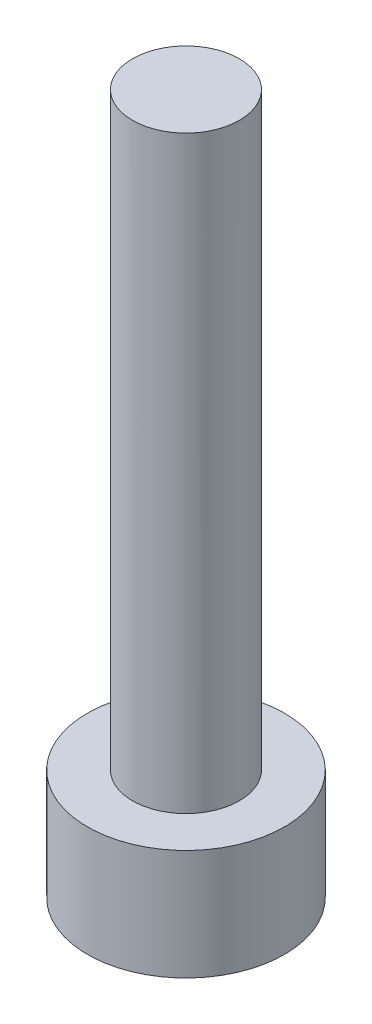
ISO-10303-21;
HEADER;
FILE_DESCRIPTION(('STEP AP214'),'2;1');
FILE_NAME('part.step','',(''),(''),'','','');
FILE_SCHEMA(('AUTOMOTIVE_DESIGN { 1 0 10303 214 1 1 1 1 }'));
ENDSEC;
DATA;
#1=APPLICATION_CONTEXT('core data for automotive mechanical design processes');
#2=APPLICATION_PROTOCOL_DEFINITION('international standard','automotive_design',2000,#1);
#3=PRODUCT_CONTEXT('',#1,'mechanical');
#4=PRODUCT('Part','Part','',(#3));
#5=PRODUCT_RELATED_PRODUCT_CATEGORY('part','',(#4));
#6=PRODUCT_DEFINITION_FORMATION('','',#4);
#7=PRODUCT_DEFINITION_CONTEXT('part definition',#1,'design');
#8=PRODUCT_DEFINITION('design','',#6,#7);
#9=PRODUCT_DEFINITION_SHAPE('','',#8);
#10=(LENGTH_UNIT() NAMED_UNIT(*) SI_UNIT(.MILLI.,.METRE.));
#11=(NAMED_UNIT(*) PLANE_ANGLE_UNIT() SI_UNIT($,.RADIAN.));
#12=(NAMED_UNIT(*) SI_UNIT($,.STERADIAN.) SOLID_ANGLE_UNIT());
#13=UNCERTAINTY_MEASURE_WITH_UNIT(LENGTH_MEASURE(1.E-05),#10,'distance_accuracy_value','');
#14=(GEOMETRIC_REPRESENTATION_CONTEXT(3) GLOBAL_UNCERTAINTY_ASSIGNED_CONTEXT((#13)) GLOBAL_UNIT_ASSIGNED_CONTEXT((#10,
#11,#12)) REPRESENTATION_CONTEXT('',''));
#15=CARTESIAN_POINT('',(0.,0.,0.));
#16=DIRECTION('',(0.,0.,1.));
#17=DIRECTION('',(1.,0.,0.));
#18=AXIS2_PLACEMENT_3D('',#15,#16,#17);
#19=CARTESIAN_POINT('',(0.,16.,0.));
#20=DIRECTION('',(0.,-1.,0.));
#21=DIRECTION('',(0.,0.,-1.));
#22=AXIS2_PLACEMENT_3D('',#19,#20,#21);
#23=CYLINDRICAL_SURFACE('',#22,1.45);
#24=CARTESIAN_POINT('',(0.,16.,0.));
#25=DIRECTION('',(0.,1.,0.));
#26=DIRECTION('',(0.,0.,1.));
#27=AXIS2_PLACEMENT_3D('',#24,#25,#26);
#28=CIRCLE('',#27,1.45);
#29=CARTESIAN_POINT('',(0.,16.,1.45));
#30=VERTEX_POINT('',#29);
#31=EDGE_CURVE('E11',#30,#30,#28,.T.);
#32=ORIENTED_EDGE('',*,*,#31,.F.);
#33=EDGE_LOOP('',(#32));
#34=FACE_BOUND('',#33,.T.);
#35=CARTESIAN_POINT('',(0.,0.,0.));
#36=DIRECTION('',(0.,-1.,0.));
#37=DIRECTION('',(0.,0.,-1.));
#38=AXIS2_PLACEMENT_3D('',#35,#36,#37);
#39=CIRCLE('',#38,1.45);
#40=CARTESIAN_POINT('',(0.,0.,-1.45));
#41=VERTEX_POINT('',#40);
#42=EDGE_CURVE('E46',#41,#41,#39,.T.);
#43=ORIENTED_EDGE('',*,*,#42,.F.);
#44=EDGE_LOOP('',(#43));
#45=FACE_BOUND('',#44,.T.);
#46=ADVANCED_FACE('F38',(#34,#45),#23,.T.);
#47=CARTESIAN_POINT('',(0.,16.,0.));
#48=DIRECTION('',(0.,1.,0.));
#49=DIRECTION('',(0.,0.,1.));
#50=AXIS2_PLACEMENT_3D('',#47,#48,#49);
#51=PLANE('',#50);
#52=ORIENTED_EDGE('',*,*,#31,.T.);
#53=EDGE_LOOP('',(#52));
#54=FACE_BOUND('',#53,.T.);
#55=ADVANCED_FACE('F187',(#54),#51,.T.);
#56=CARTESIAN_POINT('',(0.,0.,0.));
#57=DIRECTION('',(0.,-1.,0.));
#58=DIRECTION('',(0.,0.,-1.));
#59=AXIS2_PLACEMENT_3D('',#56,#57,#58);
#60=PLANE('',#59);
#61=CARTESIAN_POINT('',(0.,0.,0.));
#62=DIRECTION('',(0.,-1.,0.));
#63=DIRECTION('',(0.,0.,-1.));
#64=AXIS2_PLACEMENT_3D('',#61,#62,#63);
#65=CIRCLE('',#64,2.675);
#66=CARTESIAN_POINT('',(0.,0.,-2.675));
#67=VERTEX_POINT('',#66);
#68=EDGE_CURVE('E165',#67,#67,#65,.T.);
#69=ORIENTED_EDGE('',*,*,#68,.F.);
#70=EDGE_LOOP('',(#69));
#71=FACE_BOUND('',#70,.T.);
#72=ORIENTED_EDGE('',*,*,#42,.T.);
#73=EDGE_LOOP('',(#72));
#74=FACE_BOUND('',#73,.T.);
#75=ADVANCED_FACE('F184',(#71,#74),#60,.F.);
#76=CARTESIAN_POINT('',(0.,-3.,0.));
#77=DIRECTION('',(0.,1.,0.));
#78=DIRECTION('',(0.,0.,1.));
#79=AXIS2_PLACEMENT_3D('',#76,#77,#78);
#80=CYLINDRICAL_SURFACE('',#79,2.675);
#81=CARTESIAN_POINT('',(0.,-3.,0.));
#82=DIRECTION('',(0.,-1.,0.));
#83=DIRECTION('',(0.,0.,-1.));
#84=AXIS2_PLACEMENT_3D('',#81,#82,#83);
#85=CIRCLE('',#84,2.675);
#86=CARTESIAN_POINT('',(0.,-3.,-2.675));
#87=VERTEX_POINT('',#86);
#88=EDGE_CURVE('E174',#87,#87,#85,.T.);
#89=ORIENTED_EDGE('',*,*,#88,.F.);
#90=EDGE_LOOP('',(#89));
#91=FACE_BOUND('',#90,.T.);
#92=ORIENTED_EDGE('',*,*,#68,.T.);
#93=EDGE_LOOP('',(#92));
#94=FACE_BOUND('',#93,.T.);
#95=ADVANCED_FACE('F197',(#91,#94),#80,.T.);
#96=CARTESIAN_POINT('',(0.,-3.,0.));
#97=DIRECTION('',(0.,-1.,0.));
#98=DIRECTION('',(0.,0.,-1.));
#99=AXIS2_PLACEMENT_3D('',#96,#97,#98);
#100=PLANE('',#99);
#101=DIRECTION('',(0.23586840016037,0.,0.971785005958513));
#102=VECTOR('',#101,1.);
#103=CARTESIAN_POINT('',(1.25340948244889,-3.,-1.19539310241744));
#104=LINE('',#103,#102);
#105=CARTESIAN_POINT('',(1.25340948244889,-3.,-1.19539310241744));
#106=VERTEX_POINT('',#105);
#107=CARTESIAN_POINT('',(1.66194553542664,-3.,0.487787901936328));
#108=VERTEX_POINT('',#107);
#109=EDGE_CURVE('E55',#106,#108,#104,.T.);
#110=ORIENTED_EDGE('',*,*,#109,.F.);
#111=DIRECTION('',(0.95952470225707,0.,0.281624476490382));
#112=VECTOR('',#111,1.);
#113=CARTESIAN_POINT('',(-0.408536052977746,-3.,-1.68318100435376));
#114=LINE('',#113,#112);
#115=CARTESIAN_POINT('',(-0.408536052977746,-3.,-1.68318100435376));
#116=VERTEX_POINT('',#115);
#117=EDGE_CURVE('E159',#116,#106,#114,.T.);
#118=ORIENTED_EDGE('',*,*,#117,.F.);
#119=DIRECTION('',(0.723656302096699,0.,-0.690160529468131));
#120=VECTOR('',#119,1.);
#121=CARTESIAN_POINT('',(-1.66194553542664,-3.,-0.487787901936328));
#122=LINE('',#121,#120);
#123=CARTESIAN_POINT('',(-1.66194553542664,-3.,-0.487787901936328));
#124=VERTEX_POINT('',#123);
#125=EDGE_CURVE('E156',#124,#116,#122,.T.);
#126=ORIENTED_EDGE('',*,*,#125,.F.);
#127=DIRECTION('',(-0.23586840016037,0.,-0.971785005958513));
#128=VECTOR('',#127,1.);
#129=CARTESIAN_POINT('',(-1.25340948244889,-3.,1.19539310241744));
#130=LINE('',#129,#128);
#131=CARTESIAN_POINT('',(-1.25340948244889,-3.,1.19539310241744));
#132=VERTEX_POINT('',#131);
#133=EDGE_CURVE('E113',#132,#124,#130,.T.);
#134=ORIENTED_EDGE('',*,*,#133,.F.);
#135=DIRECTION('',(-0.95952470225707,0.,-0.281624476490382));
#136=VECTOR('',#135,1.);
#137=CARTESIAN_POINT('',(0.408536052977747,-3.,1.68318100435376));
#138=LINE('',#137,#136);
#139=CARTESIAN_POINT('',(0.408536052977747,-3.,1.68318100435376));
#140=VERTEX_POINT('',#139);
#141=EDGE_CURVE('E150',#140,#132,#138,.T.);
#142=ORIENTED_EDGE('',*,*,#141,.F.);
#143=DIRECTION('',(-0.723656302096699,0.,0.690160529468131));
#144=VECTOR('',#143,1.);
#145=CARTESIAN_POINT('',(1.66194553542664,-3.,0.487787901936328));
#146=LINE('',#145,#144);
#147=EDGE_CURVE('E146',#108,#140,#146,.T.);
#148=ORIENTED_EDGE('',*,*,#147,.F.);
#149=EDGE_LOOP('',(#110,#118,#126,#134,#142,#148));
#150=FACE_BOUND('',#149,.T.);
#151=ORIENTED_EDGE('',*,*,#88,.T.);
#152=EDGE_LOOP('',(#151));
#153=FACE_BOUND('',#152,.T.);
#154=ADVANCED_FACE('F202',(#150,#153),#100,.T.);
#155=CARTESIAN_POINT('',(1.25340948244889,-1.,-1.19539310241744));
#156=DIRECTION('',(0.971785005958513,0.,-0.23586840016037));
#157=DIRECTION('',(-0.23586840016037,0.,-0.971785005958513));
#158=AXIS2_PLACEMENT_3D('',#155,#156,#157);
#159=PLANE('',#158);
#160=ORIENTED_EDGE('',*,*,#109,.T.);
#161=DIRECTION('',(0.,-1.,0.));
#162=VECTOR('',#161,1.);
#163=CARTESIAN_POINT('',(1.66194553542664,-1.,0.487787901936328));
#164=LINE('',#163,#162);
#165=CARTESIAN_POINT('',(1.66194553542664,-1.,0.487787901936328));
#166=VERTEX_POINT('',#165);
#167=EDGE_CURVE('E92',#166,#108,#164,.T.);
#168=ORIENTED_EDGE('',*,*,#167,.F.);
#169=DIRECTION('',(0.23586840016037,0.,0.971785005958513));
#170=VECTOR('',#169,1.);
#171=CARTESIAN_POINT('',(1.25340948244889,-1.,-1.19539310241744));
#172=LINE('',#171,#170);
#173=CARTESIAN_POINT('',(1.25340948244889,-1.,-1.19539310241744));
#174=VERTEX_POINT('',#173);
#175=EDGE_CURVE('E162',#174,#166,#172,.T.);
#176=ORIENTED_EDGE('',*,*,#175,.F.);
#177=DIRECTION('',(0.,-1.,0.));
#178=VECTOR('',#177,1.);
#179=CARTESIAN_POINT('',(1.25340948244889,-1.,-1.19539310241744));
#180=LINE('',#179,#178);
#181=EDGE_CURVE('E66',#174,#106,#180,.T.);
#182=ORIENTED_EDGE('',*,*,#181,.T.);
#183=EDGE_LOOP('',(#160,#168,#176,#182));
#184=FACE_BOUND('',#183,.T.);
#185=ADVANCED_FACE('F207',(#184),#159,.F.);
#186=CARTESIAN_POINT('',(-0.408536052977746,-1.,-1.68318100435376));
#187=DIRECTION('',(0.281624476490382,0.,-0.95952470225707));
#188=DIRECTION('',(-0.95952470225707,0.,-0.281624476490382));
#189=AXIS2_PLACEMENT_3D('',#186,#187,#188);
#190=PLANE('',#189);
#191=ORIENTED_EDGE('',*,*,#117,.T.);
#192=ORIENTED_EDGE('',*,*,#181,.F.);
#193=DIRECTION('',(0.95952470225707,0.,0.281624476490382));
#194=VECTOR('',#193,1.);
#195=CARTESIAN_POINT('',(-0.408536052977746,-1.,-1.68318100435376));
#196=LINE('',#195,#194);
#197=CARTESIAN_POINT('',(-0.408536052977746,-1.,-1.68318100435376));
#198=VERTEX_POINT('',#197);
#199=EDGE_CURVE('E127',#198,#174,#196,.T.);
#200=ORIENTED_EDGE('',*,*,#199,.F.);
#201=DIRECTION('',(0.,-1.,0.));
#202=VECTOR('',#201,1.);
#203=CARTESIAN_POINT('',(-0.408536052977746,-1.,-1.68318100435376));
#204=LINE('',#203,#202);
#205=EDGE_CURVE('E118',#198,#116,#204,.T.);
#206=ORIENTED_EDGE('',*,*,#205,.T.);
#207=EDGE_LOOP('',(#191,#192,#200,#206));
#208=FACE_BOUND('',#207,.T.);
#209=ADVANCED_FACE('F211',(#208),#190,.F.);
#210=CARTESIAN_POINT('',(-1.66194553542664,-1.,-0.487787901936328));
#211=DIRECTION('',(-0.690160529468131,0.,-0.723656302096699));
#212=DIRECTION('',(-0.723656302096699,0.,0.690160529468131));
#213=AXIS2_PLACEMENT_3D('',#210,#211,#212);
#214=PLANE('',#213);
#215=ORIENTED_EDGE('',*,*,#125,.T.);
#216=ORIENTED_EDGE('',*,*,#205,.F.);
#217=DIRECTION('',(0.723656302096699,0.,-0.690160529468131));
#218=VECTOR('',#217,1.);
#219=CARTESIAN_POINT('',(-1.66194553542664,-1.,-0.487787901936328));
#220=LINE('',#219,#218);
#221=CARTESIAN_POINT('',(-1.66194553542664,-1.,-0.487787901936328));
#222=VERTEX_POINT('',#221);
#223=EDGE_CURVE('E122',#222,#198,#220,.T.);
#224=ORIENTED_EDGE('',*,*,#223,.F.);
#225=DIRECTION('',(0.,-1.,0.));
#226=VECTOR('',#225,1.);
#227=CARTESIAN_POINT('',(-1.66194553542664,-1.,-0.487787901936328));
#228=LINE('',#227,#226);
#229=EDGE_CURVE('E106',#222,#124,#228,.T.);
#230=ORIENTED_EDGE('',*,*,#229,.T.);
#231=EDGE_LOOP('',(#215,#216,#224,#230));
#232=FACE_BOUND('',#231,.T.);
#233=ADVANCED_FACE('F123',(#232),#214,.F.);
#234=CARTESIAN_POINT('',(-1.25340948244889,-1.,1.19539310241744));
#235=DIRECTION('',(-0.971785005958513,0.,0.23586840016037));
#236=DIRECTION('',(0.23586840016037,0.,0.971785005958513));
#237=AXIS2_PLACEMENT_3D('',#234,#235,#236);
#238=PLANE('',#237);
#239=ORIENTED_EDGE('',*,*,#133,.T.);
#240=ORIENTED_EDGE('',*,*,#229,.F.);
#241=DIRECTION('',(-0.23586840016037,0.,-0.971785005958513));
#242=VECTOR('',#241,1.);
#243=CARTESIAN_POINT('',(-1.25340948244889,-1.,1.19539310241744));
#244=LINE('',#243,#242);
#245=CARTESIAN_POINT('',(-1.25340948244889,-1.,1.19539310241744));
#246=VERTEX_POINT('',#245);
#247=EDGE_CURVE('E110',#246,#222,#244,.T.);
#248=ORIENTED_EDGE('',*,*,#247,.F.);
#249=DIRECTION('',(0.,-1.,0.));
#250=VECTOR('',#249,1.);
#251=CARTESIAN_POINT('',(-1.25340948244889,-1.,1.19539310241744));
#252=LINE('',#251,#250);
#253=EDGE_CURVE('E119',#246,#132,#252,.T.);
#254=ORIENTED_EDGE('',*,*,#253,.T.);
#255=EDGE_LOOP('',(#239,#240,#248,#254));
#256=FACE_BOUND('',#255,.T.);
#257=ADVANCED_FACE('F108',(#256),#238,.F.);
#258=CARTESIAN_POINT('',(0.408536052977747,-1.,1.68318100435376));
#259=DIRECTION('',(-0.281624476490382,0.,0.95952470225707));
#260=DIRECTION('',(0.95952470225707,0.,0.281624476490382));
#261=AXIS2_PLACEMENT_3D('',#258,#259,#260);
#262=PLANE('',#261);
#263=ORIENTED_EDGE('',*,*,#141,.T.);
#264=ORIENTED_EDGE('',*,*,#253,.F.);
#265=DIRECTION('',(-0.95952470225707,0.,-0.281624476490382));
#266=VECTOR('',#265,1.);
#267=CARTESIAN_POINT('',(0.408536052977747,-1.,1.68318100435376));
#268=LINE('',#267,#266);
#269=CARTESIAN_POINT('',(0.408536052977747,-1.,1.68318100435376));
#270=VERTEX_POINT('',#269);
#271=EDGE_CURVE('E133',#270,#246,#268,.T.);
#272=ORIENTED_EDGE('',*,*,#271,.F.);
#273=DIRECTION('',(0.,-1.,0.));
#274=VECTOR('',#273,1.);
#275=CARTESIAN_POINT('',(0.408536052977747,-1.,1.68318100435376));
#276=LINE('',#275,#274);
#277=EDGE_CURVE('E169',#270,#140,#276,.T.);
#278=ORIENTED_EDGE('',*,*,#277,.T.);
#279=EDGE_LOOP('',(#263,#264,#272,#278));
#280=FACE_BOUND('',#279,.T.);
#281=ADVANCED_FACE('F215',(#280),#262,.F.);
#282=CARTESIAN_POINT('',(1.66194553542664,-1.,0.487787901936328));
#283=DIRECTION('',(0.690160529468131,0.,0.723656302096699));
#284=DIRECTION('',(0.723656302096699,0.,-0.690160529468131));
#285=AXIS2_PLACEMENT_3D('',#282,#283,#284);
#286=PLANE('',#285);
#287=ORIENTED_EDGE('',*,*,#147,.T.);
#288=ORIENTED_EDGE('',*,*,#277,.F.);
#289=DIRECTION('',(-0.723656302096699,0.,0.690160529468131));
#290=VECTOR('',#289,1.);
#291=CARTESIAN_POINT('',(1.66194553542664,-1.,0.487787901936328));
#292=LINE('',#291,#290);
#293=EDGE_CURVE('E138',#166,#270,#292,.T.);
#294=ORIENTED_EDGE('',*,*,#293,.F.);
#295=ORIENTED_EDGE('',*,*,#167,.T.);
#296=EDGE_LOOP('',(#287,#288,#294,#295));
#297=FACE_BOUND('',#296,.T.);
#298=ADVANCED_FACE('F212',(#297),#286,.F.);
#299=CARTESIAN_POINT('',(0.,-1.,0.));
#300=DIRECTION('',(0.,-1.,0.));
#301=DIRECTION('',(0.,0.,-1.));
#302=AXIS2_PLACEMENT_3D('',#299,#300,#301);
#303=PLANE('',#302);
#304=ORIENTED_EDGE('',*,*,#175,.T.);
#305=ORIENTED_EDGE('',*,*,#293,.T.);
#306=ORIENTED_EDGE('',*,*,#271,.T.);
#307=ORIENTED_EDGE('',*,*,#247,.T.);
#308=ORIENTED_EDGE('',*,*,#223,.T.);
#309=ORIENTED_EDGE('',*,*,#199,.T.);
#310=EDGE_LOOP('',(#304,#305,#306,#307,#308,#309));
#311=FACE_BOUND('',#310,.T.);
#312=ADVANCED_FACE('F130',(#311),#303,.T.);
#313=CLOSED_SHELL('',(#46,#55,#75,#95,#154,#185,#209,#233,#257,#281,#298,#312));
#314=MANIFOLD_SOLID_BREP('B2',#313);
#315=ADVANCED_BREP_SHAPE_REPRESENTATION('',(#18,#314),#14);
#316=SHAPE_DEFINITION_REPRESENTATION(#9,#315);
ENDSEC;
END-ISO-10303-21;
